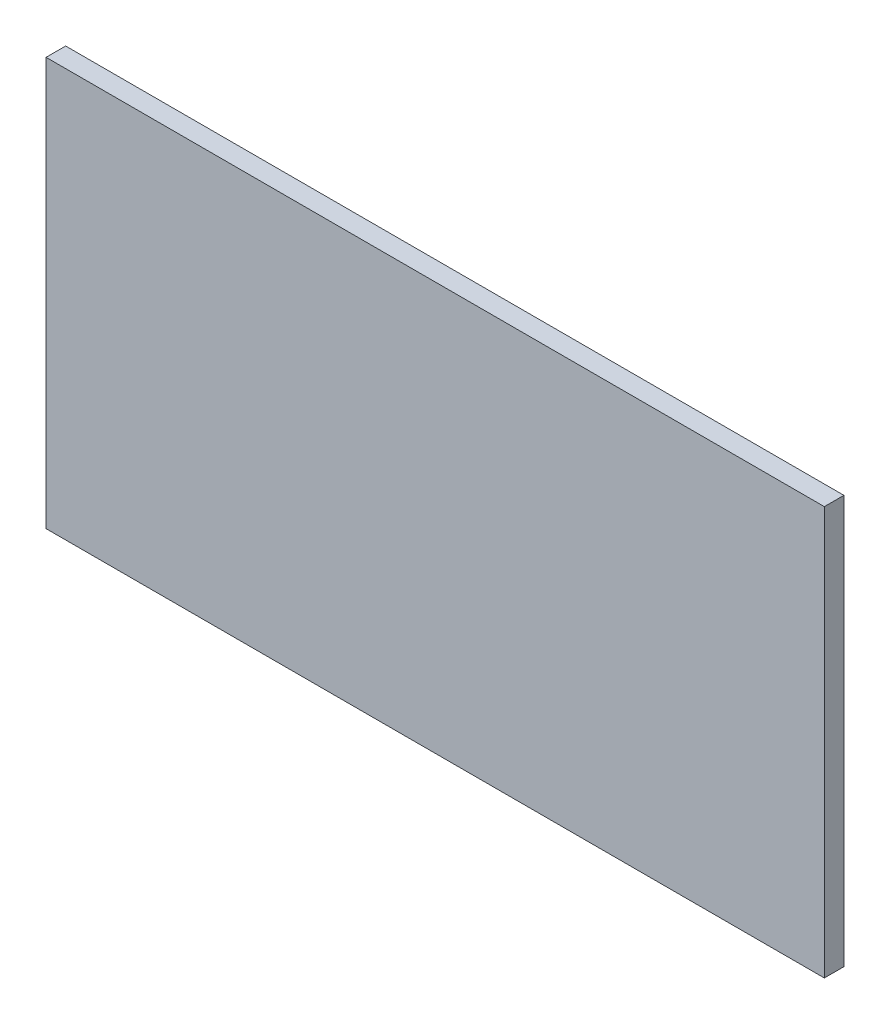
ISO-10303-21;
HEADER;
FILE_DESCRIPTION(('STEP AP214'),'2;1');
FILE_NAME('part.step','',(''),(''),'','','');
FILE_SCHEMA(('AUTOMOTIVE_DESIGN { 1 0 10303 214 1 1 1 1 }'));
ENDSEC;
DATA;
#1=APPLICATION_CONTEXT('core data for automotive mechanical design processes');
#2=APPLICATION_PROTOCOL_DEFINITION('international standard','automotive_design',2000,#1);
#3=PRODUCT_CONTEXT('',#1,'mechanical');
#4=PRODUCT('Part','Part','',(#3));
#5=PRODUCT_RELATED_PRODUCT_CATEGORY('part','',(#4));
#6=PRODUCT_DEFINITION_FORMATION('','',#4);
#7=PRODUCT_DEFINITION_CONTEXT('part definition',#1,'design');
#8=PRODUCT_DEFINITION('design','',#6,#7);
#9=PRODUCT_DEFINITION_SHAPE('','',#8);
#10=(LENGTH_UNIT() NAMED_UNIT(*) SI_UNIT(.MILLI.,.METRE.));
#11=(NAMED_UNIT(*) PLANE_ANGLE_UNIT() SI_UNIT($,.RADIAN.));
#12=(NAMED_UNIT(*) SI_UNIT($,.STERADIAN.) SOLID_ANGLE_UNIT());
#13=UNCERTAINTY_MEASURE_WITH_UNIT(LENGTH_MEASURE(1.E-05),#10,'distance_accuracy_value','');
#14=(GEOMETRIC_REPRESENTATION_CONTEXT(3) GLOBAL_UNCERTAINTY_ASSIGNED_CONTEXT((#13)) GLOBAL_UNIT_ASSIGNED_CONTEXT((#10,
#11,#12)) REPRESENTATION_CONTEXT('',''));
#15=CARTESIAN_POINT('',(0.,0.,0.));
#16=DIRECTION('',(0.,0.,1.));
#17=DIRECTION('',(1.,0.,0.));
#18=AXIS2_PLACEMENT_3D('',#15,#16,#17);
#19=CARTESIAN_POINT('',(-39.75,-20.85,2.));
#20=DIRECTION('',(1.,0.,0.));
#21=DIRECTION('',(0.,0.,-1.));
#22=AXIS2_PLACEMENT_3D('',#19,#20,#21);
#23=PLANE('',#22);
#24=DIRECTION('',(0.,-1.,0.));
#25=VECTOR('',#24,1.);
#26=CARTESIAN_POINT('',(-39.75,-20.85,0.));
#27=LINE('',#26,#25);
#28=CARTESIAN_POINT('',(-39.75,20.85,0.));
#29=VERTEX_POINT('',#28);
#30=CARTESIAN_POINT('',(-39.75,-20.85,0.));
#31=VERTEX_POINT('',#30);
#32=EDGE_CURVE('E98',#29,#31,#27,.T.);
#33=ORIENTED_EDGE('',*,*,#32,.T.);
#34=DIRECTION('',(0.,0.,-1.));
#35=VECTOR('',#34,1.);
#36=CARTESIAN_POINT('',(-39.75,-20.85,2.));
#37=LINE('',#36,#35);
#38=CARTESIAN_POINT('',(-39.75,-20.85,2.));
#39=VERTEX_POINT('',#38);
#40=EDGE_CURVE('E11',#39,#31,#37,.T.);
#41=ORIENTED_EDGE('',*,*,#40,.F.);
#42=DIRECTION('',(0.,-1.,0.));
#43=VECTOR('',#42,1.);
#44=CARTESIAN_POINT('',(-39.75,-20.85,2.));
#45=LINE('',#44,#43);
#46=CARTESIAN_POINT('',(-39.75,20.85,2.));
#47=VERTEX_POINT('',#46);
#48=EDGE_CURVE('E86',#47,#39,#45,.T.);
#49=ORIENTED_EDGE('',*,*,#48,.F.);
#50=DIRECTION('',(0.,0.,-1.));
#51=VECTOR('',#50,1.);
#52=CARTESIAN_POINT('',(-39.75,20.85,2.));
#53=LINE('',#52,#51);
#54=EDGE_CURVE('E94',#47,#29,#53,.T.);
#55=ORIENTED_EDGE('',*,*,#54,.T.);
#56=EDGE_LOOP('',(#33,#41,#49,#55));
#57=FACE_BOUND('',#56,.T.);
#58=ADVANCED_FACE('F35',(#57),#23,.F.);
#59=CARTESIAN_POINT('',(39.75,-20.85,2.));
#60=DIRECTION('',(0.,1.,0.));
#61=DIRECTION('',(-1.,0.,0.));
#62=AXIS2_PLACEMENT_3D('',#59,#60,#61);
#63=PLANE('',#62);
#64=DIRECTION('',(1.,0.,0.));
#65=VECTOR('',#64,1.);
#66=CARTESIAN_POINT('',(39.75,-20.85,0.));
#67=LINE('',#66,#65);
#68=CARTESIAN_POINT('',(39.75,-20.85,0.));
#69=VERTEX_POINT('',#68);
#70=EDGE_CURVE('E90',#31,#69,#67,.T.);
#71=ORIENTED_EDGE('',*,*,#70,.T.);
#72=DIRECTION('',(0.,0.,-1.));
#73=VECTOR('',#72,1.);
#74=CARTESIAN_POINT('',(39.75,-20.85,2.));
#75=LINE('',#74,#73);
#76=CARTESIAN_POINT('',(39.75,-20.85,2.));
#77=VERTEX_POINT('',#76);
#78=EDGE_CURVE('E43',#77,#69,#75,.T.);
#79=ORIENTED_EDGE('',*,*,#78,.F.);
#80=DIRECTION('',(1.,0.,0.));
#81=VECTOR('',#80,1.);
#82=CARTESIAN_POINT('',(39.75,-20.85,2.));
#83=LINE('',#82,#81);
#84=EDGE_CURVE('E81',#39,#77,#83,.T.);
#85=ORIENTED_EDGE('',*,*,#84,.F.);
#86=ORIENTED_EDGE('',*,*,#40,.T.);
#87=EDGE_LOOP('',(#71,#79,#85,#86));
#88=FACE_BOUND('',#87,.T.);
#89=ADVANCED_FACE('F89',(#88),#63,.F.);
#90=CARTESIAN_POINT('',(39.75,-20.85,2.));
#91=DIRECTION('',(-1.,0.,0.));
#92=DIRECTION('',(0.,0.,1.));
#93=AXIS2_PLACEMENT_3D('',#90,#91,#92);
#94=PLANE('',#93);
#95=DIRECTION('',(0.,1.,0.));
#96=VECTOR('',#95,1.);
#97=CARTESIAN_POINT('',(39.75,-20.85,0.));
#98=LINE('',#97,#96);
#99=CARTESIAN_POINT('',(39.75,20.85,0.));
#100=VERTEX_POINT('',#99);
#101=EDGE_CURVE('E68',#69,#100,#98,.T.);
#102=ORIENTED_EDGE('',*,*,#101,.T.);
#103=DIRECTION('',(0.,0.,-1.));
#104=VECTOR('',#103,1.);
#105=CARTESIAN_POINT('',(39.75,20.85,2.));
#106=LINE('',#105,#104);
#107=CARTESIAN_POINT('',(39.75,20.85,2.));
#108=VERTEX_POINT('',#107);
#109=EDGE_CURVE('E91',#108,#100,#106,.T.);
#110=ORIENTED_EDGE('',*,*,#109,.F.);
#111=DIRECTION('',(0.,1.,0.));
#112=VECTOR('',#111,1.);
#113=CARTESIAN_POINT('',(39.75,-20.85,2.));
#114=LINE('',#113,#112);
#115=EDGE_CURVE('E84',#77,#108,#114,.T.);
#116=ORIENTED_EDGE('',*,*,#115,.F.);
#117=ORIENTED_EDGE('',*,*,#78,.T.);
#118=EDGE_LOOP('',(#102,#110,#116,#117));
#119=FACE_BOUND('',#118,.T.);
#120=ADVANCED_FACE('F92',(#119),#94,.F.);
#121=CARTESIAN_POINT('',(39.75,20.85,2.));
#122=DIRECTION('',(0.,-1.,0.));
#123=DIRECTION('',(1.,0.,0.));
#124=AXIS2_PLACEMENT_3D('',#121,#122,#123);
#125=PLANE('',#124);
#126=DIRECTION('',(-1.,0.,0.));
#127=VECTOR('',#126,1.);
#128=CARTESIAN_POINT('',(39.75,20.85,0.));
#129=LINE('',#128,#127);
#130=EDGE_CURVE('E74',#100,#29,#129,.T.);
#131=ORIENTED_EDGE('',*,*,#130,.T.);
#132=ORIENTED_EDGE('',*,*,#54,.F.);
#133=DIRECTION('',(-1.,0.,0.));
#134=VECTOR('',#133,1.);
#135=CARTESIAN_POINT('',(39.75,20.85,2.));
#136=LINE('',#135,#134);
#137=EDGE_CURVE('E51',#108,#47,#136,.T.);
#138=ORIENTED_EDGE('',*,*,#137,.F.);
#139=ORIENTED_EDGE('',*,*,#109,.T.);
#140=EDGE_LOOP('',(#131,#132,#138,#139));
#141=FACE_BOUND('',#140,.T.);
#142=ADVANCED_FACE('F105',(#141),#125,.F.);
#143=CARTESIAN_POINT('',(0.,0.,2.));
#144=DIRECTION('',(0.,0.,1.));
#145=DIRECTION('',(1.,0.,0.));
#146=AXIS2_PLACEMENT_3D('',#143,#144,#145);
#147=PLANE('',#146);
#148=ORIENTED_EDGE('',*,*,#48,.T.);
#149=ORIENTED_EDGE('',*,*,#84,.T.);
#150=ORIENTED_EDGE('',*,*,#115,.T.);
#151=ORIENTED_EDGE('',*,*,#137,.T.);
#152=EDGE_LOOP('',(#148,#149,#150,#151));
#153=FACE_BOUND('',#152,.T.);
#154=ADVANCED_FACE('F82',(#153),#147,.T.);
#155=CARTESIAN_POINT('',(0.,0.,0.));
#156=DIRECTION('',(0.,0.,1.));
#157=DIRECTION('',(1.,0.,0.));
#158=AXIS2_PLACEMENT_3D('',#155,#156,#157);
#159=PLANE('',#158);
#160=ORIENTED_EDGE('',*,*,#32,.F.);
#161=ORIENTED_EDGE('',*,*,#130,.F.);
#162=ORIENTED_EDGE('',*,*,#101,.F.);
#163=ORIENTED_EDGE('',*,*,#70,.F.);
#164=EDGE_LOOP('',(#160,#161,#162,#163));
#165=FACE_BOUND('',#164,.T.);
#166=ADVANCED_FACE('F108',(#165),#159,.F.);
#167=CLOSED_SHELL('',(#58,#89,#120,#142,#154,#166));
#168=MANIFOLD_SOLID_BREP('B2',#167);
#169=ADVANCED_BREP_SHAPE_REPRESENTATION('',(#18,#168),#14);
#170=SHAPE_DEFINITION_REPRESENTATION(#9,#169);
ENDSEC;
END-ISO-10303-21;
